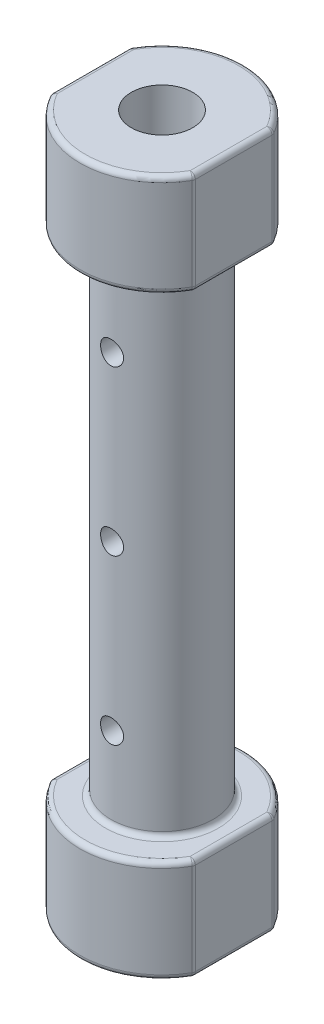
from build123d import *

# Parameters (mm, degrees)
SKETCH1_R                            = 7.9375
BOSS_EXTRUDE1_DEPTH                  = 38.1
SKETCH2_R                            = 12.7
BOSS_EXTRUDE2_DEPTH                  = 15.875
F_3_8_0_375_DIAMETER_HOLE1_D         = 9.525
CUT_EXTRUDE1_DEPTH                   = 110.433918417
F_9_64_0_14063_DIAMETER_HOLE1_REACH  = 84.763
F_9_64_0_14063_DIAMETER_HOLE1_BORE_R = 1.786001
FILLET9_R                            = 0.79375


with BuildPart() as part:
    # Sketch1 → Boss-Extrude1 (new, symmetric)
    with BuildSketch(Plane(origin=(0, 0, 0), x_dir=(1, 0, 0), z_dir=(0, 1, 0))):
        with Locations(Location((0, 0, 0), (0, 0, 90))):
            Circle(SKETCH1_R)
    extrude(amount=BOSS_EXTRUDE1_DEPTH, both=True)

    # Sketch2 → Boss-Extrude2 (add)
    with BuildSketch(Plane(origin=(0, 38.1, 0), x_dir=(1, 0, 0), z_dir=(0, 1, 0))):
        with Locations(Location((0, 0, 0), (0, 0, 270))):
            Circle(SKETCH2_R)
    boss_extrude2 = extrude(amount=BOSS_EXTRUDE2_DEPTH)

    # Mirror1: Boss-Extrude2 across plane
    add(boss_extrude2.mirror(Plane.ZX))

    # 3_8 _0.375_ Diameter Hole1 (through all)
    with Locations(Plane(origin=(0, 53.975, 0), x_dir=(1, 0, 0), z_dir=(0, 1, 0))):
        with Locations((0, 0)):
            Hole(F_3_8_0_375_DIAMETER_HOLE1_D / 2)

    # Sketch5 → Cut-Extrude1 (cut, through all)
    with BuildSketch(Plane(origin=(0, 53.975, 0), x_dir=(1, 0, 0), z_dir=(0, 1, 0))):
        with BuildLine():
            Line((-11.1125, 6.148361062), (-11.1125, -6.148361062))
            ThreePointArc((-11.1125, -6.148361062), (-12.7, 0), (-11.1125, 6.148361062))
        make_face()
        with BuildLine():
            Line((11.1125, 6.148361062), (11.1125, -6.148361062))
            ThreePointArc((11.1125, -6.148361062), (12.7, 0), (11.1125, 6.148361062))
        make_face()
    extrude(amount=-CUT_EXTRUDE1_DEPTH, mode=Mode.SUBTRACT)

    # 9_64 _0.14063_ Diameter Hole1 bore (on position points) → 9_64 _0.14063_ Diameter Hole1 (cut, up to next)
    with BuildSketch(Plane(origin=(0, 25.4, 7.9375), x_dir=(0, 1, 0), z_dir=(0, 0, 1)), mode=Mode.PRIVATE) as f_9_64_0_14063_diameter_hole1_sk1:
        Circle(F_9_64_0_14063_DIAMETER_HOLE1_BORE_R)
    f_9_64_0_14063_diameter_hole1_tool1 = extrude(f_9_64_0_14063_diameter_hole1_sk1.sketch, amount=-F_9_64_0_14063_DIAMETER_HOLE1_REACH, mode=Mode.PRIVATE) & part.part
    # 9_64 _0.14063_ Diameter Hole1 bore (on position points) → 9_64 _0.14063_ Diameter Hole1 (cut, up to next)
    with BuildSketch(Plane(origin=(0, 25.4, 7.9375), x_dir=(0, 1, 0), z_dir=(0, 0, 1)), mode=Mode.PRIVATE) as f_9_64_0_14063_diameter_hole1_sk2:
        with Locations((-25.4, 0)):
            Circle(F_9_64_0_14063_DIAMETER_HOLE1_BORE_R)
    f_9_64_0_14063_diameter_hole1_tool2 = extrude(f_9_64_0_14063_diameter_hole1_sk2.sketch, amount=-F_9_64_0_14063_DIAMETER_HOLE1_REACH, mode=Mode.PRIVATE) & part.part
    # 9_64 _0.14063_ Diameter Hole1 bore (on position points) → 9_64 _0.14063_ Diameter Hole1 (cut, up to next)
    with BuildSketch(Plane(origin=(0, 25.4, 7.9375), x_dir=(0, 1, 0), z_dir=(0, 0, 1)), mode=Mode.PRIVATE) as f_9_64_0_14063_diameter_hole1_sk3:
        with Locations((-50.8, 0)):
            Circle(F_9_64_0_14063_DIAMETER_HOLE1_BORE_R)
    f_9_64_0_14063_diameter_hole1_tool3 = extrude(f_9_64_0_14063_diameter_hole1_sk3.sketch, amount=-F_9_64_0_14063_DIAMETER_HOLE1_REACH, mode=Mode.PRIVATE) & part.part
    add(f_9_64_0_14063_diameter_hole1_tool1.solids().sort_by_distance((0, 25.4, 7.9375))[0], mode=Mode.SUBTRACT)
    add(f_9_64_0_14063_diameter_hole1_tool2.solids().sort_by_distance((0, 0, 7.9375))[0], mode=Mode.SUBTRACT)
    add(f_9_64_0_14063_diameter_hole1_tool3.solids().sort_by_distance((0, -25.4, 7.9375))[0], mode=Mode.SUBTRACT)

    # Fillet9
    fillet9_edges = [part.edges().sort_by_distance(p)[0] for p in [
        (0, -53.975, 12.7),
        (0, -38.1, 12.7),
        (0, 53.975, 12.7),
        (0, 38.1, 12.7),
        (-11.1125, 46.0375, 6.148361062),
        (-11.1125, -46.0375, 6.148361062),
        (-11.1125, 38.1, 0),
        (-11.1125, 46.0375, -6.148361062),
        (-11.1125, -46.0375, -6.148361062),
        (-11.1125, -38.1, 0),
        (-11.1125, -53.975, 0),
        (-11.1125, 53.975, 0),
        (0, -53.975, -12.7),
        (0, -38.1, -12.7),
        (0, 53.975, -12.7),
        (0, 38.1, -12.7),
        (11.1125, 46.0375, -6.148361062),
        (11.1125, -46.0375, -6.148361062),
        (0, 38.1, 7.9375),
        (11.1125, 38.1, 0),
        (11.1125, 46.0375, 6.148361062),
        (11.1125, -46.0375, 6.148361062),
        (11.1125, -38.1, 0),
        (11.1125, -53.975, 0),
        (11.1125, 53.975, 0),
        (0, -38.1, 7.9375),
    ]]
    fillet(fillet9_edges, radius=FILLET9_R)


solid = part.part
